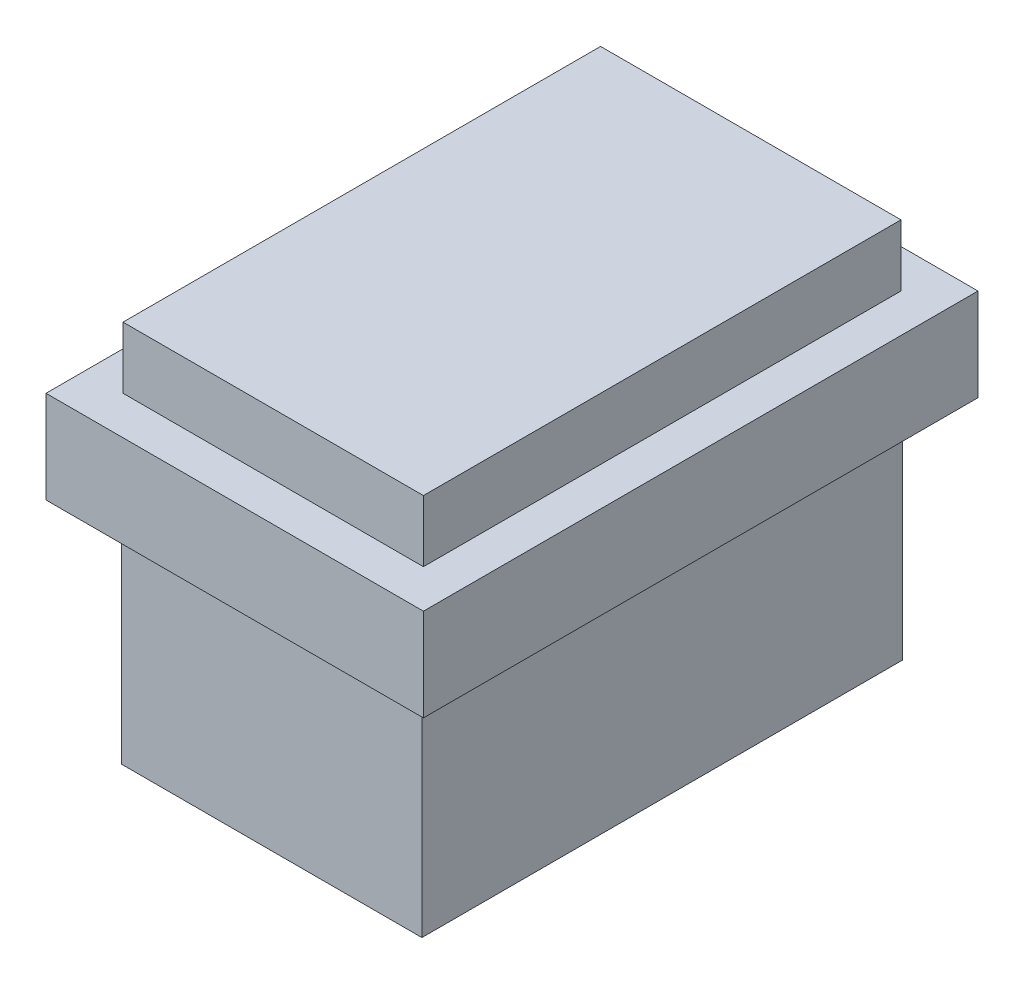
from build123d import *

# Parameters (mm, degrees)
SKETCH1_W      = 396.24
SKETCH1_H      = 187.96
EXTRUDE1_DEPTH = 123.825
SKETCH2_W      = 311.15
SKETCH2_H      = 457.2
EXTRUDE2_DEPTH = 76.2
SKETCH4_W      = 393.7
SKETCH4_H      = 50.8
EXTRUDE4_DEPTH = 123.825


with BuildPart() as part:
    # Sketch1 → Extrude1 (new, symmetric)
    with BuildSketch(Plane(origin=(0, 0, 0), x_dir=(0, 0, -1), z_dir=(1, 0, 0))):
        with Locations((0, 93.98)):
            Rectangle(SKETCH1_W, SKETCH1_H)
    extrude(amount=EXTRUDE1_DEPTH, both=True)

    # Sketch2 → Extrude2 (add)
    with BuildSketch(Plane(origin=(0, 187.96, 0), x_dir=(-1, 0, 0), z_dir=(0, 1, 0))):
        Rectangle(SKETCH2_W, SKETCH2_H)
    extrude(amount=EXTRUDE2_DEPTH)

    # Sketch4 → Extrude4 (add, symmetric)
    with BuildSketch(Plane(origin=(0, 0, 0), x_dir=(0, 0, -1), z_dir=(1, 0, 0))):
        with Locations((0, 289.56)):
            Rectangle(SKETCH4_W, SKETCH4_H)
    extrude(amount=EXTRUDE4_DEPTH, both=True)


solid = part.part
